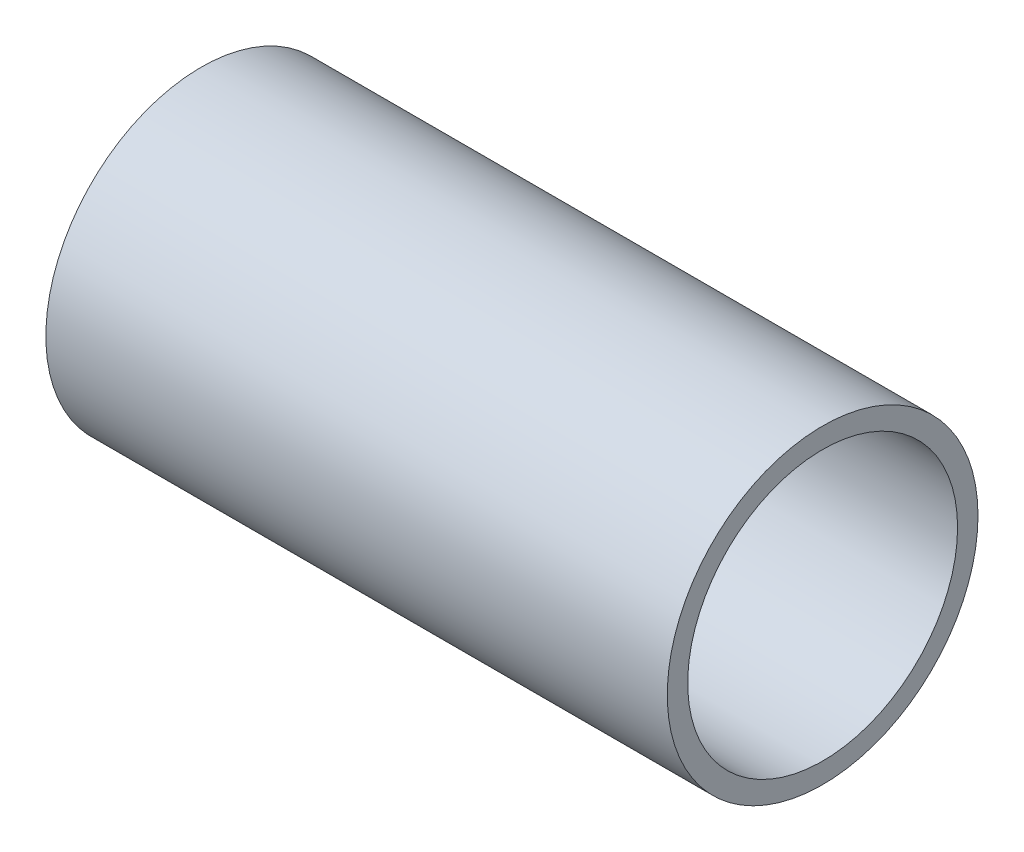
ISO-10303-21;
HEADER;
FILE_DESCRIPTION(('STEP AP214'),'2;1');
FILE_NAME('part.step','',(''),(''),'','','');
FILE_SCHEMA(('AUTOMOTIVE_DESIGN { 1 0 10303 214 1 1 1 1 }'));
ENDSEC;
DATA;
#1=APPLICATION_CONTEXT('core data for automotive mechanical design processes');
#2=APPLICATION_PROTOCOL_DEFINITION('international standard','automotive_design',2000,#1);
#3=PRODUCT_CONTEXT('',#1,'mechanical');
#4=PRODUCT('Part','Part','',(#3));
#5=PRODUCT_RELATED_PRODUCT_CATEGORY('part','',(#4));
#6=PRODUCT_DEFINITION_FORMATION('','',#4);
#7=PRODUCT_DEFINITION_CONTEXT('part definition',#1,'design');
#8=PRODUCT_DEFINITION('design','',#6,#7);
#9=PRODUCT_DEFINITION_SHAPE('','',#8);
#10=(LENGTH_UNIT() NAMED_UNIT(*) SI_UNIT(.MILLI.,.METRE.));
#11=(NAMED_UNIT(*) PLANE_ANGLE_UNIT() SI_UNIT($,.RADIAN.));
#12=(NAMED_UNIT(*) SI_UNIT($,.STERADIAN.) SOLID_ANGLE_UNIT());
#13=UNCERTAINTY_MEASURE_WITH_UNIT(LENGTH_MEASURE(1.E-05),#10,'distance_accuracy_value','');
#14=(GEOMETRIC_REPRESENTATION_CONTEXT(3) GLOBAL_UNCERTAINTY_ASSIGNED_CONTEXT((#13)) GLOBAL_UNIT_ASSIGNED_CONTEXT((#10,
#11,#12)) REPRESENTATION_CONTEXT('',''));
#15=CARTESIAN_POINT('',(0.,0.,0.));
#16=DIRECTION('',(0.,0.,1.));
#17=DIRECTION('',(1.,0.,0.));
#18=AXIS2_PLACEMENT_3D('',#15,#16,#17);
#19=CARTESIAN_POINT('',(0.,0.,0.));
#20=DIRECTION('',(1.,0.,0.));
#21=DIRECTION('',(0.,0.,-1.));
#22=AXIS2_PLACEMENT_3D('',#19,#20,#21);
#23=CYLINDRICAL_SURFACE('',#22,44.45);
#24=CARTESIAN_POINT('',(-177.8,0.,0.));
#25=DIRECTION('',(1.,0.,0.));
#26=DIRECTION('',(0.,0.,-1.));
#27=AXIS2_PLACEMENT_3D('',#24,#25,#26);
#28=CIRCLE('',#27,44.45);
#29=CARTESIAN_POINT('',(-177.8,0.,-44.45));
#30=VERTEX_POINT('',#29);
#31=EDGE_CURVE('E10',#30,#30,#28,.T.);
#32=ORIENTED_EDGE('',*,*,#31,.T.);
#33=EDGE_LOOP('',(#32));
#34=FACE_BOUND('',#33,.T.);
#35=CARTESIAN_POINT('',(0.,0.,0.));
#36=DIRECTION('',(1.,0.,0.));
#37=DIRECTION('',(0.,0.,-1.));
#38=AXIS2_PLACEMENT_3D('',#35,#36,#37);
#39=CIRCLE('',#38,44.45);
#40=CARTESIAN_POINT('',(0.,0.,-44.45));
#41=VERTEX_POINT('',#40);
#42=EDGE_CURVE('E54',#41,#41,#39,.T.);
#43=ORIENTED_EDGE('',*,*,#42,.F.);
#44=EDGE_LOOP('',(#43));
#45=FACE_BOUND('',#44,.T.);
#46=ADVANCED_FACE('F32',(#34,#45),#23,.T.);
#47=CARTESIAN_POINT('',(-177.8,-112.055187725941,0.));
#48=DIRECTION('',(-1.,0.,0.));
#49=DIRECTION('',(0.,0.,1.));
#50=AXIS2_PLACEMENT_3D('',#47,#48,#49);
#51=PLANE('',#50);
#52=CARTESIAN_POINT('',(-177.8,0.,0.));
#53=DIRECTION('',(1.,0.,0.));
#54=DIRECTION('',(0.,0.,-1.));
#55=AXIS2_PLACEMENT_3D('',#52,#53,#54);
#56=CIRCLE('',#55,29.845);
#57=CARTESIAN_POINT('',(-177.8,0.,-29.845));
#58=VERTEX_POINT('',#57);
#59=EDGE_CURVE('E38',#58,#58,#56,.T.);
#60=ORIENTED_EDGE('',*,*,#59,.T.);
#61=EDGE_LOOP('',(#60));
#62=FACE_BOUND('',#61,.T.);
#63=ORIENTED_EDGE('',*,*,#31,.F.);
#64=EDGE_LOOP('',(#63));
#65=FACE_BOUND('',#64,.T.);
#66=ADVANCED_FACE('F62',(#62,#65),#51,.T.);
#67=CARTESIAN_POINT('',(0.,0.,0.));
#68=DIRECTION('',(1.,0.,0.));
#69=DIRECTION('',(0.,0.,-1.));
#70=AXIS2_PLACEMENT_3D('',#67,#68,#69);
#71=CYLINDRICAL_SURFACE('',#70,29.845);
#72=CARTESIAN_POINT('',(-163.83,0.,0.));
#73=DIRECTION('',(1.,0.,0.));
#74=DIRECTION('',(0.,0.,-1.));
#75=AXIS2_PLACEMENT_3D('',#72,#73,#74);
#76=CIRCLE('',#75,29.845);
#77=CARTESIAN_POINT('',(-163.83,0.,-29.845));
#78=VERTEX_POINT('',#77);
#79=EDGE_CURVE('E42',#78,#78,#76,.T.);
#80=ORIENTED_EDGE('',*,*,#79,.T.);
#81=EDGE_LOOP('',(#80));
#82=FACE_BOUND('',#81,.T.);
#83=ORIENTED_EDGE('',*,*,#59,.F.);
#84=EDGE_LOOP('',(#83));
#85=FACE_BOUND('',#84,.T.);
#86=ADVANCED_FACE('F66',(#82,#85),#71,.F.);
#87=CARTESIAN_POINT('',(-163.83,0.,0.));
#88=DIRECTION('',(1.,0.,0.));
#89=DIRECTION('',(0.,0.,-1.));
#90=AXIS2_PLACEMENT_3D('',#87,#88,#89);
#91=CONICAL_SURFACE('',#90,29.845,0.654082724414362);
#92=CARTESIAN_POINT('',(-152.4,0.,0.));
#93=DIRECTION('',(1.,0.,0.));
#94=DIRECTION('',(0.,0.,-1.));
#95=AXIS2_PLACEMENT_3D('',#92,#93,#94);
#96=CIRCLE('',#95,38.608);
#97=CARTESIAN_POINT('',(-152.4,0.,-38.608));
#98=VERTEX_POINT('',#97);
#99=EDGE_CURVE('E46',#98,#98,#96,.T.);
#100=ORIENTED_EDGE('',*,*,#99,.T.);
#101=EDGE_LOOP('',(#100));
#102=FACE_BOUND('',#101,.T.);
#103=ORIENTED_EDGE('',*,*,#79,.F.);
#104=EDGE_LOOP('',(#103));
#105=FACE_BOUND('',#104,.T.);
#106=ADVANCED_FACE('F70',(#102,#105),#91,.F.);
#107=CARTESIAN_POINT('',(0.,0.,0.));
#108=DIRECTION('',(1.,0.,0.));
#109=DIRECTION('',(0.,0.,-1.));
#110=AXIS2_PLACEMENT_3D('',#107,#108,#109);
#111=CYLINDRICAL_SURFACE('',#110,38.608);
#112=CARTESIAN_POINT('',(0.,0.,0.));
#113=DIRECTION('',(1.,0.,0.));
#114=DIRECTION('',(0.,0.,-1.));
#115=AXIS2_PLACEMENT_3D('',#112,#113,#114);
#116=CIRCLE('',#115,38.608);
#117=CARTESIAN_POINT('',(0.,0.,-38.608));
#118=VERTEX_POINT('',#117);
#119=EDGE_CURVE('E51',#118,#118,#116,.T.);
#120=ORIENTED_EDGE('',*,*,#119,.T.);
#121=EDGE_LOOP('',(#120));
#122=FACE_BOUND('',#121,.T.);
#123=ORIENTED_EDGE('',*,*,#99,.F.);
#124=EDGE_LOOP('',(#123));
#125=FACE_BOUND('',#124,.T.);
#126=ADVANCED_FACE('F77',(#122,#125),#111,.F.);
#127=CARTESIAN_POINT('',(0.,-112.055187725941,0.));
#128=DIRECTION('',(1.,0.,0.));
#129=DIRECTION('',(0.,0.,-1.));
#130=AXIS2_PLACEMENT_3D('',#127,#128,#129);
#131=PLANE('',#130);
#132=ORIENTED_EDGE('',*,*,#42,.T.);
#133=EDGE_LOOP('',(#132));
#134=FACE_BOUND('',#133,.T.);
#135=ORIENTED_EDGE('',*,*,#119,.F.);
#136=EDGE_LOOP('',(#135));
#137=FACE_BOUND('',#136,.T.);
#138=ADVANCED_FACE('F58',(#134,#137),#131,.T.);
#139=CLOSED_SHELL('',(#46,#66,#86,#106,#126,#138));
#140=MANIFOLD_SOLID_BREP('B2',#139);
#141=ADVANCED_BREP_SHAPE_REPRESENTATION('',(#18,#140),#14);
#142=SHAPE_DEFINITION_REPRESENTATION(#9,#141);
ENDSEC;
END-ISO-10303-21;
